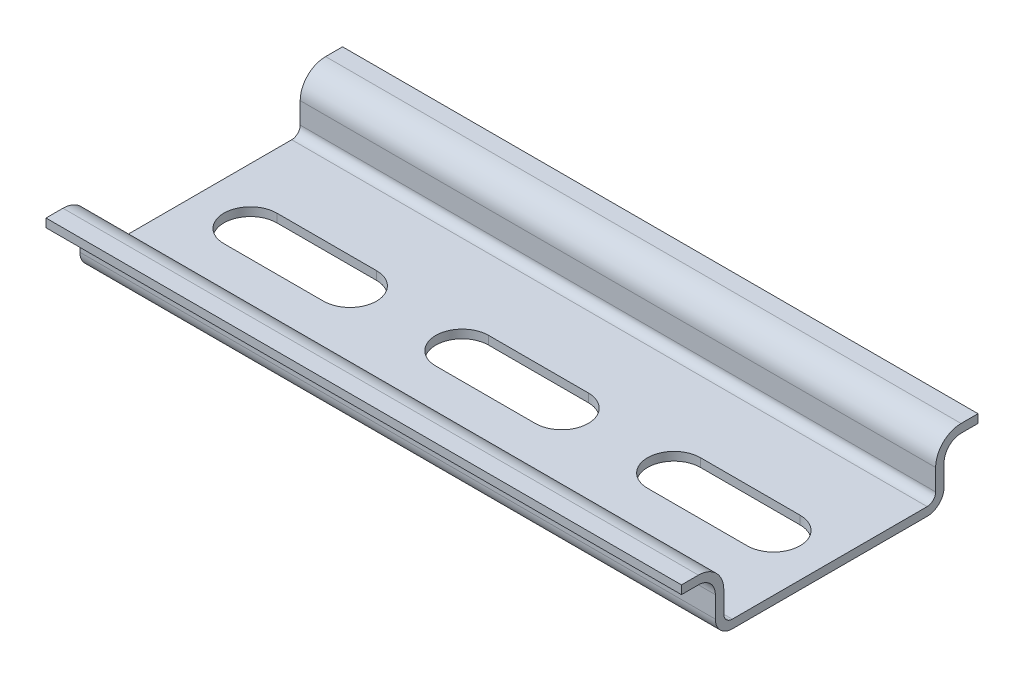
from build123d import *

# Parameters (mm, degrees)
EXTRUDE_THIN1_DEPTH      = 37.5
EXTRUDE_THIN1_DEPTH_BACK = 37.5
CUT_EXTRUDE1_REACH       = 44.057
LPATTERN1_COUNT          = 2
LPATTERN1_PITCH          = 25
LPATTERN1_COL_COUNT      = 2
LPATTERN1_COL_PITCH      = 25


with BuildPart() as part:
    # Sketch1 → Extrude-Thin1 (new, two sides: drawn at the far end of the back side and taken through both)
    with BuildSketch(Plane(origin=(0, 0, 0), x_dir=(0, 0, -1), z_dir=(1, 0, 0)).offset(-EXTRUDE_THIN1_DEPTH_BACK)):
        with BuildLine():
            Line((-17.5, 6.5), (-15.5, 6.5))
            ThreePointArc((-15.5, 6.5), (-14.085786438, 5.914213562), (-13.5, 4.5))
            Line((-13.5, 4.5), (-13.5, 2))
            ThreePointArc((-13.5, 2), (-12.914213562, 0.585786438), (-11.5, 0))
            Line((-11.5, 0), (11.5, 0))
            ThreePointArc((11.5, 0), (12.914213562, 0.585786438), (13.5, 2))
            Line((13.5, 2), (13.5, 4.5))
            ThreePointArc((13.5, 4.5), (14.085786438, 5.914213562), (15.5, 6.5))
            Line((15.5, 6.5), (17.5, 6.5))
            Line((17.5, 6.5), (17.5, 7.5))
            Line((17.5, 7.5), (15.5, 7.5))
            ThreePointArc((15.5, 7.5), (13.378679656, 6.621320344), (12.5, 4.5))
            Line((12.5, 4.5), (12.5, 2))
            ThreePointArc((12.5, 2), (12.207106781, 1.292893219), (11.5, 1))
            Line((11.5, 1), (-11.5, 1))
            ThreePointArc((-11.5, 1), (-12.207106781, 1.292893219), (-12.5, 2))
            Line((-12.5, 2), (-12.5, 4.5))
            ThreePointArc((-12.5, 4.5), (-13.378679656, 6.621320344), (-15.5, 7.5))
            Line((-15.5, 7.5), (-17.5, 7.5))
            Line((-17.5, 7.5), (-17.5, 6.5))
        make_face()
    extrude(amount=EXTRUDE_THIN1_DEPTH + EXTRUDE_THIN1_DEPTH_BACK)

    # Sketch2 → Cut-Extrude1 (cut, up to next)
    with BuildSketch(Plane.XZ, mode=Mode.PRIVATE) as cut_extrude1_sk1:
        with BuildLine():
            Line((-5.875, 3.125), (5.875, 3.125))
            ThreePointArc((5.875, 3.125), (9, 0), (5.875, -3.125))
            Line((5.875, -3.125), (-5.875, -3.125))
            ThreePointArc((-5.875, -3.125), (-9, 0), (-5.875, 3.125))
        make_face()
    cut_extrude1_tool1 = extrude(cut_extrude1_sk1.sketch, amount=-CUT_EXTRUDE1_REACH, mode=Mode.PRIVATE) & part.part
    cut_extrude1 = cut_extrude1_tool1.solids().sort_by_distance((0, 0, 0))[0]
    add(cut_extrude1, mode=Mode.SUBTRACT)

    # LPattern1: Cut-Extrude1 ×2
    with Locations(*[(i * LPATTERN1_PITCH, 0, 0) for i in range(1, LPATTERN1_COUNT)]):
        add(cut_extrude1, mode=Mode.SUBTRACT)

    # LPattern1 col: Cut-Extrude1 ×2
    with Locations(*[(-i * LPATTERN1_COL_PITCH, 0, 0) for i in range(1, LPATTERN1_COL_COUNT)]):
        add(cut_extrude1, mode=Mode.SUBTRACT)


solid = part.part
